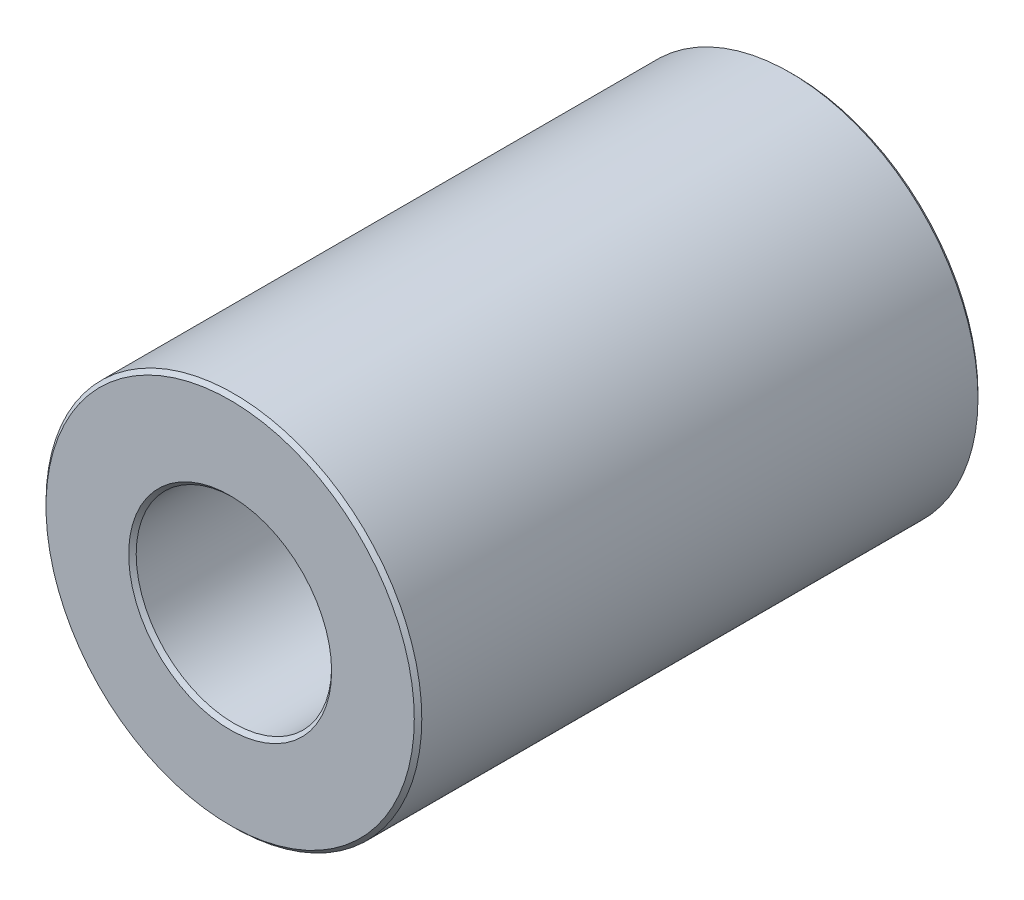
ISO-10303-21;
HEADER;
FILE_DESCRIPTION(('STEP AP214'),'2;1');
FILE_NAME('part.step','',(''),(''),'','','');
FILE_SCHEMA(('AUTOMOTIVE_DESIGN { 1 0 10303 214 1 1 1 1 }'));
ENDSEC;
DATA;
#1=APPLICATION_CONTEXT('core data for automotive mechanical design processes');
#2=APPLICATION_PROTOCOL_DEFINITION('international standard','automotive_design',2000,#1);
#3=PRODUCT_CONTEXT('',#1,'mechanical');
#4=PRODUCT('Part','Part','',(#3));
#5=PRODUCT_RELATED_PRODUCT_CATEGORY('part','',(#4));
#6=PRODUCT_DEFINITION_FORMATION('','',#4);
#7=PRODUCT_DEFINITION_CONTEXT('part definition',#1,'design');
#8=PRODUCT_DEFINITION('design','',#6,#7);
#9=PRODUCT_DEFINITION_SHAPE('','',#8);
#10=(LENGTH_UNIT() NAMED_UNIT(*) SI_UNIT(.MILLI.,.METRE.));
#11=(NAMED_UNIT(*) PLANE_ANGLE_UNIT() SI_UNIT($,.RADIAN.));
#12=(NAMED_UNIT(*) SI_UNIT($,.STERADIAN.) SOLID_ANGLE_UNIT());
#13=UNCERTAINTY_MEASURE_WITH_UNIT(LENGTH_MEASURE(1.E-05),#10,'distance_accuracy_value','');
#14=(GEOMETRIC_REPRESENTATION_CONTEXT(3) GLOBAL_UNCERTAINTY_ASSIGNED_CONTEXT((#13)) GLOBAL_UNIT_ASSIGNED_CONTEXT((#10,
#11,#12)) REPRESENTATION_CONTEXT('',''));
#15=CARTESIAN_POINT('',(0.,0.,0.));
#16=DIRECTION('',(0.,0.,1.));
#17=DIRECTION('',(1.,0.,0.));
#18=AXIS2_PLACEMENT_3D('',#15,#16,#17);
#19=CARTESIAN_POINT('',(0.,0.,7.5));
#20=DIRECTION('',(0.,0.,1.));
#21=DIRECTION('',(1.,0.,0.));
#22=AXIS2_PLACEMENT_3D('',#19,#20,#21);
#23=PLANE('',#22);
#24=CARTESIAN_POINT('',(0.,0.,7.5));
#25=DIRECTION('',(0.,0.,1.));
#26=DIRECTION('',(1.,0.,0.));
#27=AXIS2_PLACEMENT_3D('',#24,#25,#26);
#28=CIRCLE('',#27,2.7);
#29=CARTESIAN_POINT('',(2.7,0.,7.5));
#30=VERTEX_POINT('',#29);
#31=EDGE_CURVE('E10',#30,#30,#28,.F.);
#32=ORIENTED_EDGE('',*,*,#31,.T.);
#33=EDGE_LOOP('',(#32));
#34=FACE_BOUND('',#33,.T.);
#35=CARTESIAN_POINT('',(0.,0.,7.5));
#36=DIRECTION('',(0.,0.,1.));
#37=DIRECTION('',(1.,0.,0.));
#38=AXIS2_PLACEMENT_3D('',#35,#36,#37);
#39=CIRCLE('',#38,4.9);
#40=CARTESIAN_POINT('',(4.9,0.,7.5));
#41=VERTEX_POINT('',#40);
#42=EDGE_CURVE('E45',#41,#41,#39,.T.);
#43=ORIENTED_EDGE('',*,*,#42,.T.);
#44=EDGE_LOOP('',(#43));
#45=FACE_BOUND('',#44,.T.);
#46=ADVANCED_FACE('F37',(#34,#45),#23,.T.);
#47=CARTESIAN_POINT('',(0.,0.,-7.5));
#48=DIRECTION('',(0.,0.,1.));
#49=DIRECTION('',(1.,0.,0.));
#50=AXIS2_PLACEMENT_3D('',#47,#48,#49);
#51=PLANE('',#50);
#52=CARTESIAN_POINT('',(0.,0.,-7.5));
#53=DIRECTION('',(0.,0.,1.));
#54=DIRECTION('',(1.,0.,0.));
#55=AXIS2_PLACEMENT_3D('',#52,#53,#54);
#56=CIRCLE('',#55,4.9);
#57=CARTESIAN_POINT('',(4.9,0.,-7.5));
#58=VERTEX_POINT('',#57);
#59=EDGE_CURVE('E64',#58,#58,#56,.F.);
#60=ORIENTED_EDGE('',*,*,#59,.T.);
#61=EDGE_LOOP('',(#60));
#62=FACE_BOUND('',#61,.T.);
#63=CARTESIAN_POINT('',(0.,0.,-7.5));
#64=DIRECTION('',(0.,0.,1.));
#65=DIRECTION('',(1.,0.,0.));
#66=AXIS2_PLACEMENT_3D('',#63,#64,#65);
#67=CIRCLE('',#66,2.7);
#68=CARTESIAN_POINT('',(2.7,0.,-7.5));
#69=VERTEX_POINT('',#68);
#70=EDGE_CURVE('E67',#69,#69,#67,.T.);
#71=ORIENTED_EDGE('',*,*,#70,.T.);
#72=EDGE_LOOP('',(#71));
#73=FACE_BOUND('',#72,.T.);
#74=ADVANCED_FACE('F89',(#62,#73),#51,.F.);
#75=CARTESIAN_POINT('',(0.,0.,7.5));
#76=DIRECTION('',(0.,0.,-1.));
#77=DIRECTION('',(-1.,0.,0.));
#78=AXIS2_PLACEMENT_3D('',#75,#76,#77);
#79=CYLINDRICAL_SURFACE('',#78,5.);
#80=CARTESIAN_POINT('',(0.,0.,-7.4));
#81=DIRECTION('',(0.,0.,1.));
#82=DIRECTION('',(1.,0.,0.));
#83=AXIS2_PLACEMENT_3D('',#80,#81,#82);
#84=CIRCLE('',#83,5.);
#85=CARTESIAN_POINT('',(5.,0.,-7.4));
#86=VERTEX_POINT('',#85);
#87=EDGE_CURVE('E70',#86,#86,#84,.T.);
#88=ORIENTED_EDGE('',*,*,#87,.T.);
#89=EDGE_LOOP('',(#88));
#90=FACE_BOUND('',#89,.T.);
#91=CARTESIAN_POINT('',(0.,0.,7.4));
#92=DIRECTION('',(0.,0.,1.));
#93=DIRECTION('',(1.,0.,0.));
#94=AXIS2_PLACEMENT_3D('',#91,#92,#93);
#95=CIRCLE('',#94,5.);
#96=CARTESIAN_POINT('',(5.,0.,7.4));
#97=VERTEX_POINT('',#96);
#98=EDGE_CURVE('E73',#97,#97,#95,.F.);
#99=ORIENTED_EDGE('',*,*,#98,.T.);
#100=EDGE_LOOP('',(#99));
#101=FACE_BOUND('',#100,.T.);
#102=ADVANCED_FACE('F78',(#90,#101),#79,.T.);
#103=CARTESIAN_POINT('',(0.,0.,7.5));
#104=DIRECTION('',(0.,0.,-1.));
#105=DIRECTION('',(-1.,0.,0.));
#106=AXIS2_PLACEMENT_3D('',#103,#104,#105);
#107=CYLINDRICAL_SURFACE('',#106,2.6);
#108=CARTESIAN_POINT('',(0.,0.,-7.4));
#109=DIRECTION('',(0.,0.,1.));
#110=DIRECTION('',(1.,0.,0.));
#111=AXIS2_PLACEMENT_3D('',#108,#109,#110);
#112=CIRCLE('',#111,2.6);
#113=CARTESIAN_POINT('',(2.6,0.,-7.4));
#114=VERTEX_POINT('',#113);
#115=EDGE_CURVE('E52',#114,#114,#112,.F.);
#116=ORIENTED_EDGE('',*,*,#115,.T.);
#117=EDGE_LOOP('',(#116));
#118=FACE_BOUND('',#117,.T.);
#119=CARTESIAN_POINT('',(0.,0.,7.4));
#120=DIRECTION('',(0.,0.,1.));
#121=DIRECTION('',(1.,0.,0.));
#122=AXIS2_PLACEMENT_3D('',#119,#120,#121);
#123=CIRCLE('',#122,2.6);
#124=CARTESIAN_POINT('',(2.6,0.,7.4));
#125=VERTEX_POINT('',#124);
#126=EDGE_CURVE('E58',#125,#125,#123,.T.);
#127=ORIENTED_EDGE('',*,*,#126,.T.);
#128=EDGE_LOOP('',(#127));
#129=FACE_BOUND('',#128,.T.);
#130=ADVANCED_FACE('F97',(#118,#129),#107,.F.);
#131=CARTESIAN_POINT('',(0.,0.,-7.4));
#132=DIRECTION('',(0.,0.,1.));
#133=DIRECTION('',(1.,0.,0.));
#134=AXIS2_PLACEMENT_3D('',#131,#132,#133);
#135=CONICAL_SURFACE('',#134,5.,0.785398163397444);
#136=ORIENTED_EDGE('',*,*,#59,.F.);
#137=EDGE_LOOP('',(#136));
#138=FACE_BOUND('',#137,.T.);
#139=ORIENTED_EDGE('',*,*,#87,.F.);
#140=EDGE_LOOP('',(#139));
#141=FACE_BOUND('',#140,.T.);
#142=ADVANCED_FACE('F102',(#138,#141),#135,.T.);
#143=CARTESIAN_POINT('',(0.,0.,-7.5));
#144=DIRECTION('',(0.,0.,-1.));
#145=DIRECTION('',(-1.,0.,0.));
#146=AXIS2_PLACEMENT_3D('',#143,#144,#145);
#147=CONICAL_SURFACE('',#146,2.7,0.78539816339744);
#148=ORIENTED_EDGE('',*,*,#115,.F.);
#149=EDGE_LOOP('',(#148));
#150=FACE_BOUND('',#149,.T.);
#151=ORIENTED_EDGE('',*,*,#70,.F.);
#152=EDGE_LOOP('',(#151));
#153=FACE_BOUND('',#152,.T.);
#154=ADVANCED_FACE('F86',(#150,#153),#147,.F.);
#155=CARTESIAN_POINT('',(0.,0.,7.4));
#156=DIRECTION('',(0.,0.,1.));
#157=DIRECTION('',(1.,0.,0.));
#158=AXIS2_PLACEMENT_3D('',#155,#156,#157);
#159=CONICAL_SURFACE('',#158,2.6,0.785398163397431);
#160=ORIENTED_EDGE('',*,*,#31,.F.);
#161=EDGE_LOOP('',(#160));
#162=FACE_BOUND('',#161,.T.);
#163=ORIENTED_EDGE('',*,*,#126,.F.);
#164=EDGE_LOOP('',(#163));
#165=FACE_BOUND('',#164,.T.);
#166=ADVANCED_FACE('F82',(#162,#165),#159,.F.);
#167=CARTESIAN_POINT('',(0.,0.,7.5));
#168=DIRECTION('',(0.,0.,-1.));
#169=DIRECTION('',(-1.,0.,0.));
#170=AXIS2_PLACEMENT_3D('',#167,#168,#169);
#171=CONICAL_SURFACE('',#170,4.9,0.785398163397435);
#172=ORIENTED_EDGE('',*,*,#98,.F.);
#173=EDGE_LOOP('',(#172));
#174=FACE_BOUND('',#173,.T.);
#175=ORIENTED_EDGE('',*,*,#42,.F.);
#176=EDGE_LOOP('',(#175));
#177=FACE_BOUND('',#176,.T.);
#178=ADVANCED_FACE('F39',(#174,#177),#171,.T.);
#179=CLOSED_SHELL('',(#46,#74,#102,#130,#142,#154,#166,#178));
#180=MANIFOLD_SOLID_BREP('B2',#179);
#181=ADVANCED_BREP_SHAPE_REPRESENTATION('',(#18,#180),#14);
#182=SHAPE_DEFINITION_REPRESENTATION(#9,#181);
ENDSEC;
END-ISO-10303-21;
